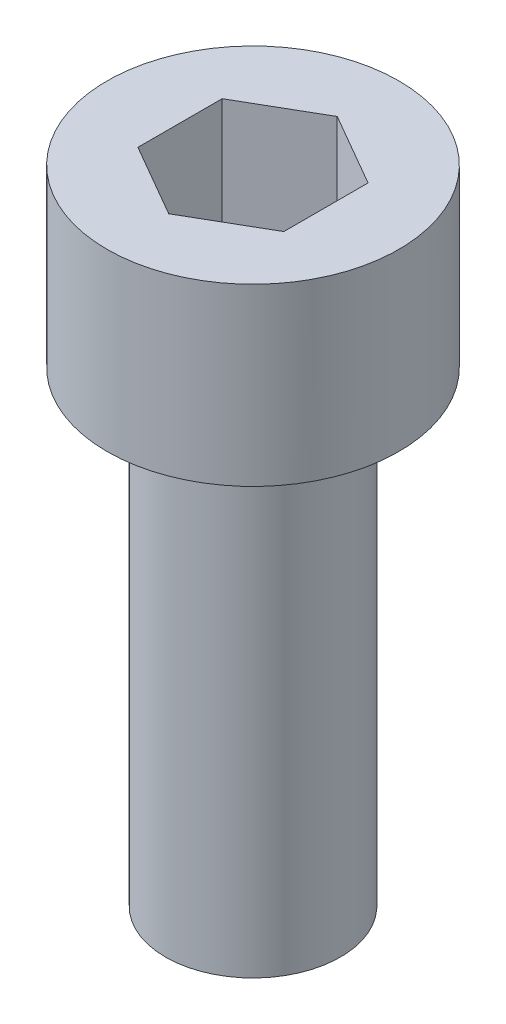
ISO-10303-21;
HEADER;
FILE_DESCRIPTION(('STEP AP214'),'2;1');
FILE_NAME('part.step','',(''),(''),'','','');
FILE_SCHEMA(('AUTOMOTIVE_DESIGN { 1 0 10303 214 1 1 1 1 }'));
ENDSEC;
DATA;
#1=APPLICATION_CONTEXT('core data for automotive mechanical design processes');
#2=APPLICATION_PROTOCOL_DEFINITION('international standard','automotive_design',2000,#1);
#3=PRODUCT_CONTEXT('',#1,'mechanical');
#4=PRODUCT('Part','Part','',(#3));
#5=PRODUCT_RELATED_PRODUCT_CATEGORY('part','',(#4));
#6=PRODUCT_DEFINITION_FORMATION('','',#4);
#7=PRODUCT_DEFINITION_CONTEXT('part definition',#1,'design');
#8=PRODUCT_DEFINITION('design','',#6,#7);
#9=PRODUCT_DEFINITION_SHAPE('','',#8);
#10=(LENGTH_UNIT() NAMED_UNIT(*) SI_UNIT(.MILLI.,.METRE.));
#11=(NAMED_UNIT(*) PLANE_ANGLE_UNIT() SI_UNIT($,.RADIAN.));
#12=(NAMED_UNIT(*) SI_UNIT($,.STERADIAN.) SOLID_ANGLE_UNIT());
#13=UNCERTAINTY_MEASURE_WITH_UNIT(LENGTH_MEASURE(1.E-05),#10,'distance_accuracy_value','');
#14=(GEOMETRIC_REPRESENTATION_CONTEXT(3) GLOBAL_UNCERTAINTY_ASSIGNED_CONTEXT((#13)) GLOBAL_UNIT_ASSIGNED_CONTEXT((#10,
#11,#12)) REPRESENTATION_CONTEXT('',''));
#15=CARTESIAN_POINT('',(0.,0.,0.));
#16=DIRECTION('',(0.,0.,1.));
#17=DIRECTION('',(1.,0.,0.));
#18=AXIS2_PLACEMENT_3D('',#15,#16,#17);
#19=CARTESIAN_POINT('',(0.,-16.,0.));
#20=DIRECTION('',(0.,1.,0.));
#21=DIRECTION('',(0.,0.,1.));
#22=AXIS2_PLACEMENT_3D('',#19,#20,#21);
#23=PLANE('',#22);
#24=CARTESIAN_POINT('',(0.,-16.,0.));
#25=DIRECTION('',(0.,1.,0.));
#26=DIRECTION('',(0.,0.,1.));
#27=AXIS2_PLACEMENT_3D('',#24,#25,#26);
#28=CIRCLE('',#27,3.);
#29=CARTESIAN_POINT('',(0.,-16.,2.99999999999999));
#30=VERTEX_POINT('',#29);
#31=EDGE_CURVE('E11',#30,#30,#28,.T.);
#32=ORIENTED_EDGE('',*,*,#31,.F.);
#33=EDGE_LOOP('',(#32));
#34=FACE_BOUND('',#33,.T.);
#35=ADVANCED_FACE('F17',(#34),#23,.F.);
#36=CARTESIAN_POINT('',(0.,0.,0.));
#37=DIRECTION('',(0.,1.,0.));
#38=DIRECTION('',(0.,0.,1.));
#39=AXIS2_PLACEMENT_3D('',#36,#37,#38);
#40=CYLINDRICAL_SURFACE('',#39,3.);
#41=CARTESIAN_POINT('',(0.,0.,0.));
#42=DIRECTION('',(0.,1.,0.));
#43=DIRECTION('',(0.,0.,1.));
#44=AXIS2_PLACEMENT_3D('',#41,#42,#43);
#45=CIRCLE('',#44,3.);
#46=CARTESIAN_POINT('',(0.,0.,2.99999999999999));
#47=VERTEX_POINT('',#46);
#48=EDGE_CURVE('E112',#47,#47,#45,.F.);
#49=ORIENTED_EDGE('',*,*,#48,.T.);
#50=EDGE_LOOP('',(#49));
#51=FACE_BOUND('',#50,.T.);
#52=ORIENTED_EDGE('',*,*,#31,.T.);
#53=EDGE_LOOP('',(#52));
#54=FACE_BOUND('',#53,.T.);
#55=ADVANCED_FACE('F19',(#51,#54),#40,.T.);
#56=CARTESIAN_POINT('',(0.,1.74,-2.88675134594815));
#57=DIRECTION('',(0.,1.,0.));
#58=DIRECTION('',(0.,0.,1.));
#59=AXIS2_PLACEMENT_3D('',#56,#57,#58);
#60=PLANE('',#59);
#61=DIRECTION('',(0.,0.,1.));
#62=VECTOR('',#61,1.);
#63=CARTESIAN_POINT('',(2.5,1.74,-1.4433756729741));
#64=LINE('',#63,#62);
#65=CARTESIAN_POINT('',(2.5,1.74,-1.44337567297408));
#66=VERTEX_POINT('',#65);
#67=CARTESIAN_POINT('',(2.5,1.74,1.44337567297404));
#68=VERTEX_POINT('',#67);
#69=EDGE_CURVE('E74',#66,#68,#64,.T.);
#70=ORIENTED_EDGE('',*,*,#69,.F.);
#71=DIRECTION('',(-0.866025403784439,0.,-0.5));
#72=VECTOR('',#71,1.);
#73=CARTESIAN_POINT('',(2.5,1.74,-1.4433756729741));
#74=LINE('',#73,#72);
#75=CARTESIAN_POINT('',(0.,1.74,-2.88675134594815));
#76=VERTEX_POINT('',#75);
#77=EDGE_CURVE('E95',#66,#76,#74,.T.);
#78=ORIENTED_EDGE('',*,*,#77,.T.);
#79=DIRECTION('',(0.866025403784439,0.,-0.5));
#80=VECTOR('',#79,1.);
#81=CARTESIAN_POINT('',(-2.5,1.74,-1.44337567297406));
#82=LINE('',#81,#80);
#83=CARTESIAN_POINT('',(-2.5,1.74,-1.44337567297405));
#84=VERTEX_POINT('',#83);
#85=EDGE_CURVE('E89',#84,#76,#82,.T.);
#86=ORIENTED_EDGE('',*,*,#85,.F.);
#87=DIRECTION('',(0.,0.,1.));
#88=VECTOR('',#87,1.);
#89=CARTESIAN_POINT('',(-2.5,1.74,-1.44337567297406));
#90=LINE('',#89,#88);
#91=CARTESIAN_POINT('',(-2.5,1.74,1.44337567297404));
#92=VERTEX_POINT('',#91);
#93=EDGE_CURVE('E109',#84,#92,#90,.T.);
#94=ORIENTED_EDGE('',*,*,#93,.T.);
#95=DIRECTION('',(0.866025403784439,0.,0.5));
#96=VECTOR('',#95,1.);
#97=CARTESIAN_POINT('',(-2.5,1.74,1.44337567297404));
#98=LINE('',#97,#96);
#99=CARTESIAN_POINT('',(0.,1.74,2.8867513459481));
#100=VERTEX_POINT('',#99);
#101=EDGE_CURVE('E103',#92,#100,#98,.T.);
#102=ORIENTED_EDGE('',*,*,#101,.T.);
#103=DIRECTION('',(-0.866025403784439,0.,0.5));
#104=VECTOR('',#103,1.);
#105=CARTESIAN_POINT('',(2.5,1.74,1.44337567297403));
#106=LINE('',#105,#104);
#107=EDGE_CURVE('E101',#68,#100,#106,.T.);
#108=ORIENTED_EDGE('',*,*,#107,.F.);
#109=EDGE_LOOP('',(#70,#78,#86,#94,#102,#108));
#110=FACE_BOUND('',#109,.T.);
#111=ADVANCED_FACE('F142',(#110),#60,.T.);
#112=CARTESIAN_POINT('',(-2.5,1.74,-1.44337567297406));
#113=DIRECTION('',(0.5,0.,0.866025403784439));
#114=DIRECTION('',(0.866025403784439,0.,-0.5));
#115=AXIS2_PLACEMENT_3D('',#112,#113,#114);
#116=PLANE('',#115);
#117=ORIENTED_EDGE('',*,*,#85,.T.);
#118=DIRECTION('',(0.,1.,0.));
#119=VECTOR('',#118,1.);
#120=CARTESIAN_POINT('',(0.,1.74,-2.88675134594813));
#121=LINE('',#120,#119);
#122=CARTESIAN_POINT('',(0.,6.,-2.88675134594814));
#123=VERTEX_POINT('',#122);
#124=EDGE_CURVE('E87',#76,#123,#121,.T.);
#125=ORIENTED_EDGE('',*,*,#124,.T.);
#126=DIRECTION('',(-0.866025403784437,0.,0.5));
#127=VECTOR('',#126,1.);
#128=CARTESIAN_POINT('',(0.,6.,-2.88675134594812));
#129=LINE('',#128,#127);
#130=CARTESIAN_POINT('',(-2.5,6.,-1.44337567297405));
#131=VERTEX_POINT('',#130);
#132=EDGE_CURVE('E80',#123,#131,#129,.T.);
#133=ORIENTED_EDGE('',*,*,#132,.T.);
#134=DIRECTION('',(0.,1.,0.));
#135=VECTOR('',#134,1.);
#136=CARTESIAN_POINT('',(-2.5,1.74,-1.44337567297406));
#137=LINE('',#136,#135);
#138=EDGE_CURVE('E92',#131,#84,#137,.F.);
#139=ORIENTED_EDGE('',*,*,#138,.T.);
#140=EDGE_LOOP('',(#117,#125,#133,#139));
#141=FACE_BOUND('',#140,.T.);
#142=ADVANCED_FACE('F150',(#141),#116,.T.);
#143=CARTESIAN_POINT('',(-2.5,1.74,-1.44337567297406));
#144=DIRECTION('',(-1.,0.,0.));
#145=DIRECTION('',(0.,-1.,0.));
#146=AXIS2_PLACEMENT_3D('',#143,#144,#145);
#147=PLANE('',#146);
#148=DIRECTION('',(0.,1.,0.));
#149=VECTOR('',#148,1.);
#150=CARTESIAN_POINT('',(-2.5,1.74,1.44337567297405));
#151=LINE('',#150,#149);
#152=CARTESIAN_POINT('',(-2.5,6.,1.44337567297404));
#153=VERTEX_POINT('',#152);
#154=EDGE_CURVE('E106',#153,#92,#151,.F.);
#155=ORIENTED_EDGE('',*,*,#154,.T.);
#156=ORIENTED_EDGE('',*,*,#93,.F.);
#157=ORIENTED_EDGE('',*,*,#138,.F.);
#158=DIRECTION('',(0.,0.,-1.));
#159=VECTOR('',#158,1.);
#160=CARTESIAN_POINT('',(-2.5,6.,0.));
#161=LINE('',#160,#159);
#162=EDGE_CURVE('E85',#131,#153,#161,.F.);
#163=ORIENTED_EDGE('',*,*,#162,.T.);
#164=EDGE_LOOP('',(#155,#156,#157,#163));
#165=FACE_BOUND('',#164,.T.);
#166=ADVANCED_FACE('F163',(#165),#147,.F.);
#167=CARTESIAN_POINT('',(-2.5,1.74,1.44337567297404));
#168=DIRECTION('',(-0.5,0.,0.866025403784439));
#169=DIRECTION('',(0.866025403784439,0.,0.5));
#170=AXIS2_PLACEMENT_3D('',#167,#168,#169);
#171=PLANE('',#170);
#172=DIRECTION('',(0.,1.,0.));
#173=VECTOR('',#172,1.);
#174=CARTESIAN_POINT('',(0.,1.74,2.8867513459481));
#175=LINE('',#174,#173);
#176=CARTESIAN_POINT('',(0.,6.,2.8867513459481));
#177=VERTEX_POINT('',#176);
#178=EDGE_CURVE('E63',#100,#177,#175,.T.);
#179=ORIENTED_EDGE('',*,*,#178,.F.);
#180=ORIENTED_EDGE('',*,*,#101,.F.);
#181=ORIENTED_EDGE('',*,*,#154,.F.);
#182=DIRECTION('',(0.866025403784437,0.,0.5));
#183=VECTOR('',#182,1.);
#184=CARTESIAN_POINT('',(-2.5,6.,1.44337567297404));
#185=LINE('',#184,#183);
#186=EDGE_CURVE('E68',#153,#177,#185,.T.);
#187=ORIENTED_EDGE('',*,*,#186,.T.);
#188=EDGE_LOOP('',(#179,#180,#181,#187));
#189=FACE_BOUND('',#188,.T.);
#190=ADVANCED_FACE('F170',(#189),#171,.F.);
#191=CARTESIAN_POINT('',(2.5,1.74,1.44337567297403));
#192=DIRECTION('',(-0.5,0.,-0.866025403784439));
#193=DIRECTION('',(-0.866025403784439,0.,0.5));
#194=AXIS2_PLACEMENT_3D('',#191,#192,#193);
#195=PLANE('',#194);
#196=ORIENTED_EDGE('',*,*,#107,.T.);
#197=ORIENTED_EDGE('',*,*,#178,.T.);
#198=DIRECTION('',(0.866025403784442,0.,-0.499999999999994));
#199=VECTOR('',#198,1.);
#200=CARTESIAN_POINT('',(0.,6.,2.88675134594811));
#201=LINE('',#200,#199);
#202=CARTESIAN_POINT('',(2.5,6.,1.44337567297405));
#203=VERTEX_POINT('',#202);
#204=EDGE_CURVE('E55',#177,#203,#201,.T.);
#205=ORIENTED_EDGE('',*,*,#204,.T.);
#206=DIRECTION('',(0.,-1.,0.));
#207=VECTOR('',#206,1.);
#208=CARTESIAN_POINT('',(2.5,1.74,1.44337567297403));
#209=LINE('',#208,#207);
#210=EDGE_CURVE('E60',#68,#203,#209,.F.);
#211=ORIENTED_EDGE('',*,*,#210,.F.);
#212=EDGE_LOOP('',(#196,#197,#205,#211));
#213=FACE_BOUND('',#212,.T.);
#214=ADVANCED_FACE('F58',(#213),#195,.T.);
#215=CARTESIAN_POINT('',(2.5,1.74,-1.4433756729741));
#216=DIRECTION('',(-1.,0.,0.));
#217=DIRECTION('',(0.,-1.,0.));
#218=AXIS2_PLACEMENT_3D('',#215,#216,#217);
#219=PLANE('',#218);
#220=ORIENTED_EDGE('',*,*,#69,.T.);
#221=ORIENTED_EDGE('',*,*,#210,.T.);
#222=DIRECTION('',(0.,0.,-1.));
#223=VECTOR('',#222,1.);
#224=CARTESIAN_POINT('',(2.5,6.,0.));
#225=LINE('',#224,#223);
#226=CARTESIAN_POINT('',(2.5,6.,-1.44337567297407));
#227=VERTEX_POINT('',#226);
#228=EDGE_CURVE('E67',#203,#227,#225,.T.);
#229=ORIENTED_EDGE('',*,*,#228,.T.);
#230=DIRECTION('',(0.,1.,0.));
#231=VECTOR('',#230,1.);
#232=CARTESIAN_POINT('',(2.5,1.74,-1.44337567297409));
#233=LINE('',#232,#231);
#234=EDGE_CURVE('E75',#227,#66,#233,.F.);
#235=ORIENTED_EDGE('',*,*,#234,.T.);
#236=EDGE_LOOP('',(#220,#221,#229,#235));
#237=FACE_BOUND('',#236,.T.);
#238=ADVANCED_FACE('F71',(#237),#219,.T.);
#239=CARTESIAN_POINT('',(2.5,1.74,-1.4433756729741));
#240=DIRECTION('',(0.5,0.,-0.866025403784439));
#241=DIRECTION('',(-0.866025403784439,0.,-0.5));
#242=AXIS2_PLACEMENT_3D('',#239,#240,#241);
#243=PLANE('',#242);
#244=ORIENTED_EDGE('',*,*,#124,.F.);
#245=ORIENTED_EDGE('',*,*,#77,.F.);
#246=ORIENTED_EDGE('',*,*,#234,.F.);
#247=DIRECTION('',(-0.86602540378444,0.,-0.5));
#248=VECTOR('',#247,1.);
#249=CARTESIAN_POINT('',(2.5,6.,-1.44337567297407));
#250=LINE('',#249,#248);
#251=EDGE_CURVE('E33',#227,#123,#250,.T.);
#252=ORIENTED_EDGE('',*,*,#251,.T.);
#253=EDGE_LOOP('',(#244,#245,#246,#252));
#254=FACE_BOUND('',#253,.T.);
#255=ADVANCED_FACE('F123',(#254),#243,.F.);
#256=CARTESIAN_POINT('',(4.75,6.,0.));
#257=DIRECTION('',(0.,-1.,0.));
#258=DIRECTION('',(0.,0.,-1.));
#259=AXIS2_PLACEMENT_3D('',#256,#257,#258);
#260=PLANE('',#259);
#261=CARTESIAN_POINT('',(0.,6.,0.));
#262=DIRECTION('',(0.,-1.,0.));
#263=DIRECTION('',(0.,0.,-1.));
#264=AXIS2_PLACEMENT_3D('',#261,#262,#263);
#265=CIRCLE('',#264,5.);
#266=CARTESIAN_POINT('',(0.,6.,-5.00000000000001));
#267=VERTEX_POINT('',#266);
#268=EDGE_CURVE('E26',#267,#267,#265,.T.);
#269=ORIENTED_EDGE('',*,*,#268,.F.);
#270=EDGE_LOOP('',(#269));
#271=FACE_BOUND('',#270,.T.);
#272=ORIENTED_EDGE('',*,*,#251,.F.);
#273=ORIENTED_EDGE('',*,*,#228,.F.);
#274=ORIENTED_EDGE('',*,*,#204,.F.);
#275=ORIENTED_EDGE('',*,*,#186,.F.);
#276=ORIENTED_EDGE('',*,*,#162,.F.);
#277=ORIENTED_EDGE('',*,*,#132,.F.);
#278=EDGE_LOOP('',(#272,#273,#274,#275,#276,#277));
#279=FACE_BOUND('',#278,.T.);
#280=ADVANCED_FACE('F77',(#271,#279),#260,.F.);
#281=CARTESIAN_POINT('',(0.,0.,0.));
#282=DIRECTION('',(0.,1.,0.));
#283=DIRECTION('',(0.,0.,1.));
#284=AXIS2_PLACEMENT_3D('',#281,#282,#283);
#285=CYLINDRICAL_SURFACE('',#284,5.);
#286=CARTESIAN_POINT('',(0.,0.,0.));
#287=DIRECTION('',(0.,1.,0.));
#288=DIRECTION('',(0.,0.,1.));
#289=AXIS2_PLACEMENT_3D('',#286,#287,#288);
#290=CIRCLE('',#289,5.);
#291=CARTESIAN_POINT('',(0.,0.,4.99999999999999));
#292=VERTEX_POINT('',#291);
#293=EDGE_CURVE('E115',#292,#292,#290,.T.);
#294=ORIENTED_EDGE('',*,*,#293,.T.);
#295=EDGE_LOOP('',(#294));
#296=FACE_BOUND('',#295,.T.);
#297=ORIENTED_EDGE('',*,*,#268,.T.);
#298=EDGE_LOOP('',(#297));
#299=FACE_BOUND('',#298,.T.);
#300=ADVANCED_FACE('F120',(#296,#299),#285,.T.);
#301=CARTESIAN_POINT('',(3.,0.,0.));
#302=DIRECTION('',(0.,1.,0.));
#303=DIRECTION('',(0.,0.,1.));
#304=AXIS2_PLACEMENT_3D('',#301,#302,#303);
#305=PLANE('',#304);
#306=ORIENTED_EDGE('',*,*,#48,.F.);
#307=EDGE_LOOP('',(#306));
#308=FACE_BOUND('',#307,.T.);
#309=ORIENTED_EDGE('',*,*,#293,.F.);
#310=EDGE_LOOP('',(#309));
#311=FACE_BOUND('',#310,.T.);
#312=ADVANCED_FACE('F131',(#308,#311),#305,.F.);
#313=CLOSED_SHELL('',(#35,#55,#111,#142,#166,#190,#214,#238,#255,#280,#300,#312));
#314=MANIFOLD_SOLID_BREP('B1',#313);
#315=ADVANCED_BREP_SHAPE_REPRESENTATION('',(#18,#314),#14);
#316=SHAPE_DEFINITION_REPRESENTATION(#9,#315);
ENDSEC;
END-ISO-10303-21;
